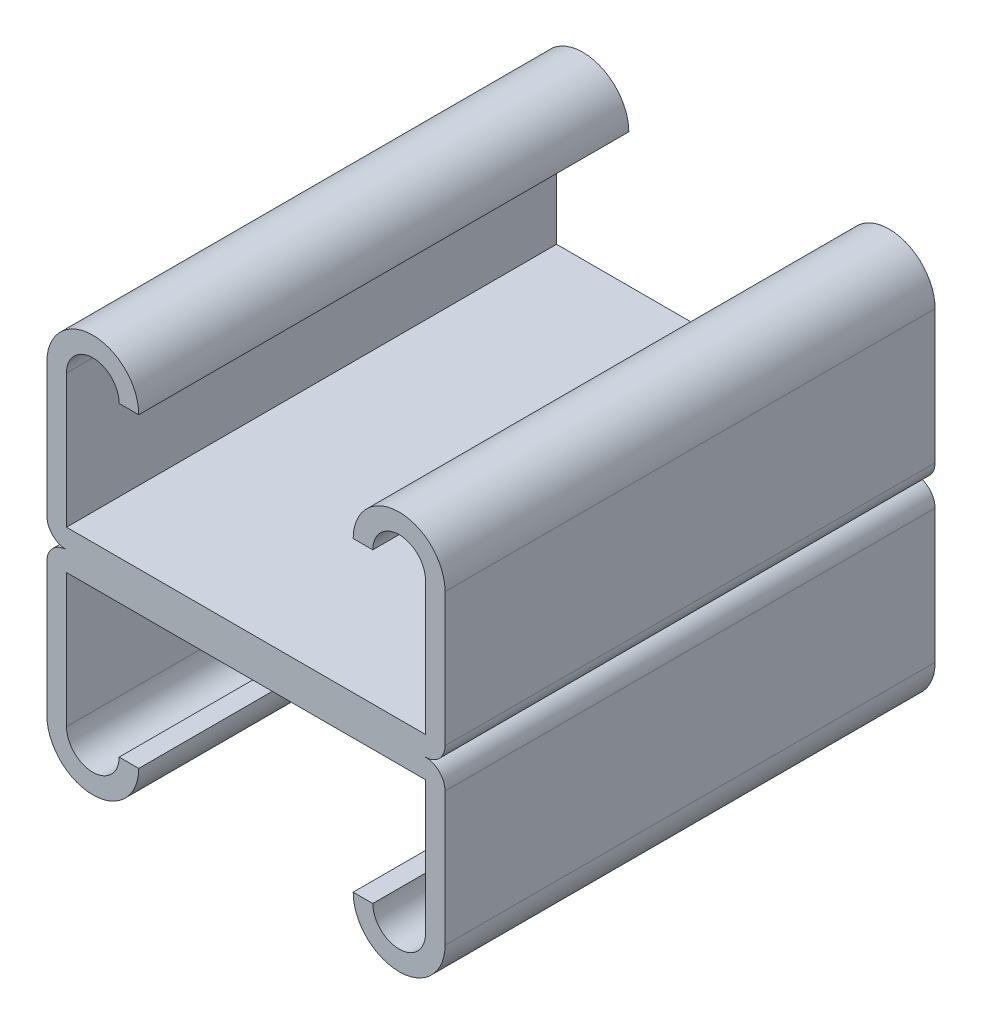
ISO-10303-21;
HEADER;
FILE_DESCRIPTION(('STEP AP214'),'2;1');
FILE_NAME('part.step','',(''),(''),'','','');
FILE_SCHEMA(('AUTOMOTIVE_DESIGN { 1 0 10303 214 1 1 1 1 }'));
ENDSEC;
DATA;
#1=APPLICATION_CONTEXT('core data for automotive mechanical design processes');
#2=APPLICATION_PROTOCOL_DEFINITION('international standard','automotive_design',2000,#1);
#3=PRODUCT_CONTEXT('',#1,'mechanical');
#4=PRODUCT('Part','Part','',(#3));
#5=PRODUCT_RELATED_PRODUCT_CATEGORY('part','',(#4));
#6=PRODUCT_DEFINITION_FORMATION('','',#4);
#7=PRODUCT_DEFINITION_CONTEXT('part definition',#1,'design');
#8=PRODUCT_DEFINITION('design','',#6,#7);
#9=PRODUCT_DEFINITION_SHAPE('','',#8);
#10=(LENGTH_UNIT() NAMED_UNIT(*) SI_UNIT(.MILLI.,.METRE.));
#11=(NAMED_UNIT(*) PLANE_ANGLE_UNIT() SI_UNIT($,.RADIAN.));
#12=(NAMED_UNIT(*) SI_UNIT($,.STERADIAN.) SOLID_ANGLE_UNIT());
#13=UNCERTAINTY_MEASURE_WITH_UNIT(LENGTH_MEASURE(1.E-05),#10,'distance_accuracy_value','');
#14=(GEOMETRIC_REPRESENTATION_CONTEXT(3) GLOBAL_UNCERTAINTY_ASSIGNED_CONTEXT((#13)) GLOBAL_UNIT_ASSIGNED_CONTEXT((#10,
#11,#12)) REPRESENTATION_CONTEXT('',''));
#15=CARTESIAN_POINT('',(0.,0.,0.));
#16=DIRECTION('',(0.,0.,1.));
#17=DIRECTION('',(1.,0.,0.));
#18=AXIS2_PLACEMENT_3D('',#15,#16,#17);
#19=CARTESIAN_POINT('',(-7.9375,7.9375,12.7));
#20=DIRECTION('',(0.,0.,-1.));
#21=DIRECTION('',(-1.,0.,0.));
#22=AXIS2_PLACEMENT_3D('',#19,#20,#21);
#23=CYLINDRICAL_SURFACE('',#22,2.38125);
#24=CARTESIAN_POINT('',(-7.9375,7.9375,-12.7));
#25=DIRECTION('',(0.,0.,1.));
#26=DIRECTION('',(-1.,0.,0.));
#27=AXIS2_PLACEMENT_3D('',#24,#25,#26);
#28=CIRCLE('',#27,2.38125);
#29=CARTESIAN_POINT('',(-5.55625,7.9375,-12.7));
#30=VERTEX_POINT('',#29);
#31=CARTESIAN_POINT('',(-10.31875,7.9375,-12.7));
#32=VERTEX_POINT('',#31);
#33=EDGE_CURVE('E172',#30,#32,#28,.T.);
#34=ORIENTED_EDGE('',*,*,#33,.T.);
#35=DIRECTION('',(0.,0.,-1.));
#36=VECTOR('',#35,1.);
#37=CARTESIAN_POINT('',(-10.31875,7.9375,12.7));
#38=LINE('',#37,#36);
#39=CARTESIAN_POINT('',(-10.31875,7.9375,12.7));
#40=VERTEX_POINT('',#39);
#41=EDGE_CURVE('E11',#40,#32,#38,.T.);
#42=ORIENTED_EDGE('',*,*,#41,.F.);
#43=CARTESIAN_POINT('',(-7.9375,7.9375,12.7));
#44=DIRECTION('',(0.,0.,1.));
#45=DIRECTION('',(-1.,0.,0.));
#46=AXIS2_PLACEMENT_3D('',#43,#44,#45);
#47=CIRCLE('',#46,2.38125);
#48=CARTESIAN_POINT('',(-5.55625,7.9375,12.7));
#49=VERTEX_POINT('',#48);
#50=EDGE_CURVE('E197',#49,#40,#47,.T.);
#51=ORIENTED_EDGE('',*,*,#50,.F.);
#52=DIRECTION('',(0.,0.,-1.));
#53=VECTOR('',#52,1.);
#54=CARTESIAN_POINT('',(-5.55625,7.9375,12.7));
#55=LINE('',#54,#53);
#56=EDGE_CURVE('E168',#49,#30,#55,.T.);
#57=ORIENTED_EDGE('',*,*,#56,.T.);
#58=EDGE_LOOP('',(#34,#42,#51,#57));
#59=FACE_BOUND('',#58,.T.);
#60=ADVANCED_FACE('F39',(#59),#23,.T.);
#61=CARTESIAN_POINT('',(-10.31875,7.9375,12.7));
#62=DIRECTION('',(1.,0.,0.));
#63=DIRECTION('',(0.,1.,0.));
#64=AXIS2_PLACEMENT_3D('',#61,#62,#63);
#65=PLANE('',#64);
#66=DIRECTION('',(0.,-1.,0.));
#67=VECTOR('',#66,1.);
#68=CARTESIAN_POINT('',(-10.31875,7.9375,-12.7));
#69=LINE('',#68,#67);
#70=CARTESIAN_POINT('',(-10.31875,1.016,-12.7));
#71=VERTEX_POINT('',#70);
#72=EDGE_CURVE('E175',#32,#71,#69,.T.);
#73=ORIENTED_EDGE('',*,*,#72,.T.);
#74=DIRECTION('',(0.,0.,-1.));
#75=VECTOR('',#74,1.);
#76=CARTESIAN_POINT('',(-10.31875,1.016,12.7));
#77=LINE('',#76,#75);
#78=CARTESIAN_POINT('',(-10.31875,1.016,12.7));
#79=VERTEX_POINT('',#78);
#80=EDGE_CURVE('E47',#79,#71,#77,.T.);
#81=ORIENTED_EDGE('',*,*,#80,.F.);
#82=DIRECTION('',(0.,-1.,0.));
#83=VECTOR('',#82,1.);
#84=CARTESIAN_POINT('',(-10.31875,7.9375,12.7));
#85=LINE('',#84,#83);
#86=EDGE_CURVE('E114',#40,#79,#85,.T.);
#87=ORIENTED_EDGE('',*,*,#86,.F.);
#88=ORIENTED_EDGE('',*,*,#41,.T.);
#89=EDGE_LOOP('',(#73,#81,#87,#88));
#90=FACE_BOUND('',#89,.T.);
#91=ADVANCED_FACE('F328',(#90),#65,.F.);
#92=CARTESIAN_POINT('',(-9.30275,1.016,12.7));
#93=DIRECTION('',(0.,0.,-1.));
#94=DIRECTION('',(-1.,0.,0.));
#95=AXIS2_PLACEMENT_3D('',#92,#93,#94);
#96=CYLINDRICAL_SURFACE('',#95,1.016);
#97=CARTESIAN_POINT('',(-9.30275,1.016,-12.7));
#98=DIRECTION('',(0.,0.,1.));
#99=DIRECTION('',(-1.,0.,0.));
#100=AXIS2_PLACEMENT_3D('',#97,#98,#99);
#101=CIRCLE('',#100,1.016);
#102=CARTESIAN_POINT('',(-9.30275,0.,-12.7));
#103=VERTEX_POINT('',#102);
#104=EDGE_CURVE('E178',#71,#103,#101,.T.);
#105=ORIENTED_EDGE('',*,*,#104,.T.);
#106=DIRECTION('',(0.,0.,-1.));
#107=VECTOR('',#106,1.);
#108=CARTESIAN_POINT('',(-9.30275,0.,12.7));
#109=LINE('',#108,#107);
#110=CARTESIAN_POINT('',(-9.30275,0.,12.7));
#111=VERTEX_POINT('',#110);
#112=EDGE_CURVE('E222',#111,#103,#109,.T.);
#113=ORIENTED_EDGE('',*,*,#112,.F.);
#114=CARTESIAN_POINT('',(-9.30275,1.016,12.7));
#115=DIRECTION('',(0.,0.,1.));
#116=DIRECTION('',(-1.,0.,0.));
#117=AXIS2_PLACEMENT_3D('',#114,#115,#116);
#118=CIRCLE('',#117,1.016);
#119=EDGE_CURVE('E230',#79,#111,#118,.T.);
#120=ORIENTED_EDGE('',*,*,#119,.F.);
#121=ORIENTED_EDGE('',*,*,#80,.T.);
#122=EDGE_LOOP('',(#105,#113,#120,#121));
#123=FACE_BOUND('',#122,.T.);
#124=ADVANCED_FACE('F228',(#123),#96,.T.);
#125=CARTESIAN_POINT('',(9.30275,1.016,12.7));
#126=DIRECTION('',(0.,0.,-1.));
#127=DIRECTION('',(-1.,0.,0.));
#128=AXIS2_PLACEMENT_3D('',#125,#126,#127);
#129=CYLINDRICAL_SURFACE('',#128,1.016);
#130=CARTESIAN_POINT('',(9.30275,1.016,-12.7));
#131=DIRECTION('',(0.,0.,1.));
#132=DIRECTION('',(1.,0.,0.));
#133=AXIS2_PLACEMENT_3D('',#130,#131,#132);
#134=CIRCLE('',#133,1.016);
#135=CARTESIAN_POINT('',(9.30275,0.,-12.7));
#136=VERTEX_POINT('',#135);
#137=CARTESIAN_POINT('',(10.31875,1.016,-12.7));
#138=VERTEX_POINT('',#137);
#139=EDGE_CURVE('E180',#136,#138,#134,.T.);
#140=ORIENTED_EDGE('',*,*,#139,.T.);
#141=DIRECTION('',(0.,0.,-1.));
#142=VECTOR('',#141,1.);
#143=CARTESIAN_POINT('',(10.31875,1.016,12.7));
#144=LINE('',#143,#142);
#145=CARTESIAN_POINT('',(10.31875,1.016,12.7));
#146=VERTEX_POINT('',#145);
#147=EDGE_CURVE('E216',#146,#138,#144,.T.);
#148=ORIENTED_EDGE('',*,*,#147,.F.);
#149=CARTESIAN_POINT('',(9.30275,1.016,12.7));
#150=DIRECTION('',(0.,0.,1.));
#151=DIRECTION('',(1.,0.,0.));
#152=AXIS2_PLACEMENT_3D('',#149,#150,#151);
#153=CIRCLE('',#152,1.016);
#154=CARTESIAN_POINT('',(9.30275,0.,12.7));
#155=VERTEX_POINT('',#154);
#156=EDGE_CURVE('E292',#155,#146,#153,.T.);
#157=ORIENTED_EDGE('',*,*,#156,.F.);
#158=DIRECTION('',(0.,0.,-1.));
#159=VECTOR('',#158,1.);
#160=CARTESIAN_POINT('',(9.30275,0.,12.7));
#161=LINE('',#160,#159);
#162=EDGE_CURVE('E219',#155,#136,#161,.T.);
#163=ORIENTED_EDGE('',*,*,#162,.T.);
#164=EDGE_LOOP('',(#140,#148,#157,#163));
#165=FACE_BOUND('',#164,.T.);
#166=ADVANCED_FACE('F335',(#165),#129,.T.);
#167=CARTESIAN_POINT('',(10.31875,1.016,12.7));
#168=DIRECTION('',(-1.,0.,0.));
#169=DIRECTION('',(0.,-1.,0.));
#170=AXIS2_PLACEMENT_3D('',#167,#168,#169);
#171=PLANE('',#170);
#172=DIRECTION('',(0.,1.,0.));
#173=VECTOR('',#172,1.);
#174=CARTESIAN_POINT('',(10.31875,1.016,-12.7));
#175=LINE('',#174,#173);
#176=CARTESIAN_POINT('',(10.31875,7.9375,-12.7));
#177=VERTEX_POINT('',#176);
#178=EDGE_CURVE('E182',#138,#177,#175,.T.);
#179=ORIENTED_EDGE('',*,*,#178,.T.);
#180=DIRECTION('',(0.,0.,-1.));
#181=VECTOR('',#180,1.);
#182=CARTESIAN_POINT('',(10.31875,7.9375,12.7));
#183=LINE('',#182,#181);
#184=CARTESIAN_POINT('',(10.31875,7.9375,12.7));
#185=VERTEX_POINT('',#184);
#186=EDGE_CURVE('E213',#185,#177,#183,.T.);
#187=ORIENTED_EDGE('',*,*,#186,.F.);
#188=DIRECTION('',(0.,1.,0.));
#189=VECTOR('',#188,1.);
#190=CARTESIAN_POINT('',(10.31875,1.016,12.7));
#191=LINE('',#190,#189);
#192=EDGE_CURVE('E294',#146,#185,#191,.T.);
#193=ORIENTED_EDGE('',*,*,#192,.F.);
#194=ORIENTED_EDGE('',*,*,#147,.T.);
#195=EDGE_LOOP('',(#179,#187,#193,#194));
#196=FACE_BOUND('',#195,.T.);
#197=ADVANCED_FACE('F340',(#196),#171,.F.);
#198=CARTESIAN_POINT('',(7.9375,7.9375,12.7));
#199=DIRECTION('',(0.,0.,-1.));
#200=DIRECTION('',(-1.,0.,0.));
#201=AXIS2_PLACEMENT_3D('',#198,#199,#200);
#202=CYLINDRICAL_SURFACE('',#201,2.38125);
#203=CARTESIAN_POINT('',(7.9375,7.9375,-12.7));
#204=DIRECTION('',(0.,0.,1.));
#205=DIRECTION('',(1.,0.,0.));
#206=AXIS2_PLACEMENT_3D('',#203,#204,#205);
#207=CIRCLE('',#206,2.38125);
#208=CARTESIAN_POINT('',(5.55625,7.9375,-12.7));
#209=VERTEX_POINT('',#208);
#210=EDGE_CURVE('E184',#177,#209,#207,.T.);
#211=ORIENTED_EDGE('',*,*,#210,.T.);
#212=DIRECTION('',(0.,0.,-1.));
#213=VECTOR('',#212,1.);
#214=CARTESIAN_POINT('',(5.55625,7.9375,12.7));
#215=LINE('',#214,#213);
#216=CARTESIAN_POINT('',(5.55625,7.9375,12.7));
#217=VERTEX_POINT('',#216);
#218=EDGE_CURVE('E210',#217,#209,#215,.T.);
#219=ORIENTED_EDGE('',*,*,#218,.F.);
#220=CARTESIAN_POINT('',(7.9375,7.9375,12.7));
#221=DIRECTION('',(0.,0.,1.));
#222=DIRECTION('',(1.,0.,0.));
#223=AXIS2_PLACEMENT_3D('',#220,#221,#222);
#224=CIRCLE('',#223,2.38125);
#225=EDGE_CURVE('E296',#185,#217,#224,.T.);
#226=ORIENTED_EDGE('',*,*,#225,.F.);
#227=ORIENTED_EDGE('',*,*,#186,.T.);
#228=EDGE_LOOP('',(#211,#219,#226,#227));
#229=FACE_BOUND('',#228,.T.);
#230=ADVANCED_FACE('F343',(#229),#202,.T.);
#231=CARTESIAN_POINT('',(5.55625,7.9375,12.7));
#232=DIRECTION('',(0.,1.,0.));
#233=DIRECTION('',(0.,0.,1.));
#234=AXIS2_PLACEMENT_3D('',#231,#232,#233);
#235=PLANE('',#234);
#236=DIRECTION('',(1.,0.,0.));
#237=VECTOR('',#236,1.);
#238=CARTESIAN_POINT('',(5.55625,7.9375,-12.7));
#239=LINE('',#238,#237);
#240=CARTESIAN_POINT('',(6.57225,7.9375,-12.7));
#241=VERTEX_POINT('',#240);
#242=EDGE_CURVE('E186',#209,#241,#239,.T.);
#243=ORIENTED_EDGE('',*,*,#242,.T.);
#244=DIRECTION('',(0.,0.,-1.));
#245=VECTOR('',#244,1.);
#246=CARTESIAN_POINT('',(6.57225,7.9375,12.7));
#247=LINE('',#246,#245);
#248=CARTESIAN_POINT('',(6.57225,7.9375,12.7));
#249=VERTEX_POINT('',#248);
#250=EDGE_CURVE('E207',#249,#241,#247,.T.);
#251=ORIENTED_EDGE('',*,*,#250,.F.);
#252=DIRECTION('',(1.,0.,0.));
#253=VECTOR('',#252,1.);
#254=CARTESIAN_POINT('',(5.55625,7.9375,12.7));
#255=LINE('',#254,#253);
#256=EDGE_CURVE('E298',#217,#249,#255,.T.);
#257=ORIENTED_EDGE('',*,*,#256,.F.);
#258=ORIENTED_EDGE('',*,*,#218,.T.);
#259=EDGE_LOOP('',(#243,#251,#257,#258));
#260=FACE_BOUND('',#259,.T.);
#261=ADVANCED_FACE('F347',(#260),#235,.F.);
#262=CARTESIAN_POINT('',(7.9375,7.9375,12.7));
#263=DIRECTION('',(0.,0.,-1.));
#264=DIRECTION('',(-1.,0.,0.));
#265=AXIS2_PLACEMENT_3D('',#262,#263,#264);
#266=CYLINDRICAL_SURFACE('',#265,1.36525);
#267=CARTESIAN_POINT('',(7.9375,7.9375,-12.7));
#268=DIRECTION('',(0.,0.,-1.));
#269=DIRECTION('',(1.,0.,0.));
#270=AXIS2_PLACEMENT_3D('',#267,#268,#269);
#271=CIRCLE('',#270,1.36525);
#272=CARTESIAN_POINT('',(9.30275,7.9375,-12.7));
#273=VERTEX_POINT('',#272);
#274=EDGE_CURVE('E188',#241,#273,#271,.T.);
#275=ORIENTED_EDGE('',*,*,#274,.T.);
#276=DIRECTION('',(0.,0.,-1.));
#277=VECTOR('',#276,1.);
#278=CARTESIAN_POINT('',(9.30275,7.9375,12.7));
#279=LINE('',#278,#277);
#280=CARTESIAN_POINT('',(9.30275,7.9375,12.7));
#281=VERTEX_POINT('',#280);
#282=EDGE_CURVE('E204',#281,#273,#279,.T.);
#283=ORIENTED_EDGE('',*,*,#282,.F.);
#284=CARTESIAN_POINT('',(7.9375,7.9375,12.7));
#285=DIRECTION('',(0.,0.,-1.));
#286=DIRECTION('',(1.,0.,0.));
#287=AXIS2_PLACEMENT_3D('',#284,#285,#286);
#288=CIRCLE('',#287,1.36525);
#289=EDGE_CURVE('E300',#249,#281,#288,.T.);
#290=ORIENTED_EDGE('',*,*,#289,.F.);
#291=ORIENTED_EDGE('',*,*,#250,.T.);
#292=EDGE_LOOP('',(#275,#283,#290,#291));
#293=FACE_BOUND('',#292,.T.);
#294=ADVANCED_FACE('F351',(#293),#266,.F.);
#295=CARTESIAN_POINT('',(9.30275,1.016,12.7));
#296=DIRECTION('',(1.,0.,0.));
#297=DIRECTION('',(0.,1.,0.));
#298=AXIS2_PLACEMENT_3D('',#295,#296,#297);
#299=PLANE('',#298);
#300=DIRECTION('',(0.,-1.,0.));
#301=VECTOR('',#300,1.);
#302=CARTESIAN_POINT('',(9.30275,1.016,-12.7));
#303=LINE('',#302,#301);
#304=CARTESIAN_POINT('',(9.30275,1.016,-12.7));
#305=VERTEX_POINT('',#304);
#306=EDGE_CURVE('E190',#273,#305,#303,.T.);
#307=ORIENTED_EDGE('',*,*,#306,.T.);
#308=DIRECTION('',(0.,0.,-1.));
#309=VECTOR('',#308,1.);
#310=CARTESIAN_POINT('',(9.30275,1.016,12.7));
#311=LINE('',#310,#309);
#312=CARTESIAN_POINT('',(9.30275,1.016,12.7));
#313=VERTEX_POINT('',#312);
#314=EDGE_CURVE('E201',#313,#305,#311,.T.);
#315=ORIENTED_EDGE('',*,*,#314,.F.);
#316=DIRECTION('',(0.,-1.,0.));
#317=VECTOR('',#316,1.);
#318=CARTESIAN_POINT('',(9.30275,1.016,12.7));
#319=LINE('',#318,#317);
#320=EDGE_CURVE('E302',#281,#313,#319,.T.);
#321=ORIENTED_EDGE('',*,*,#320,.F.);
#322=ORIENTED_EDGE('',*,*,#282,.T.);
#323=EDGE_LOOP('',(#307,#315,#321,#322));
#324=FACE_BOUND('',#323,.T.);
#325=ADVANCED_FACE('F308',(#324),#299,.F.);
#326=CARTESIAN_POINT('',(-9.30275,1.016,12.7));
#327=DIRECTION('',(0.,-1.,0.));
#328=DIRECTION('',(1.,0.,0.));
#329=AXIS2_PLACEMENT_3D('',#326,#327,#328);
#330=PLANE('',#329);
#331=DIRECTION('',(-1.,0.,0.));
#332=VECTOR('',#331,1.);
#333=CARTESIAN_POINT('',(-9.30275,1.016,-12.7));
#334=LINE('',#333,#332);
#335=CARTESIAN_POINT('',(-9.30275,1.016,-12.7));
#336=VERTEX_POINT('',#335);
#337=EDGE_CURVE('E192',#305,#336,#334,.T.);
#338=ORIENTED_EDGE('',*,*,#337,.T.);
#339=DIRECTION('',(0.,0.,-1.));
#340=VECTOR('',#339,1.);
#341=CARTESIAN_POINT('',(-9.30275,1.016,12.7));
#342=LINE('',#341,#340);
#343=CARTESIAN_POINT('',(-9.30275,1.016,12.7));
#344=VERTEX_POINT('',#343);
#345=EDGE_CURVE('E163',#344,#336,#342,.T.);
#346=ORIENTED_EDGE('',*,*,#345,.F.);
#347=DIRECTION('',(-1.,0.,0.));
#348=VECTOR('',#347,1.);
#349=CARTESIAN_POINT('',(-9.30275,1.016,12.7));
#350=LINE('',#349,#348);
#351=EDGE_CURVE('E154',#313,#344,#350,.T.);
#352=ORIENTED_EDGE('',*,*,#351,.F.);
#353=ORIENTED_EDGE('',*,*,#314,.T.);
#354=EDGE_LOOP('',(#338,#346,#352,#353));
#355=FACE_BOUND('',#354,.T.);
#356=ADVANCED_FACE('F312',(#355),#330,.F.);
#357=CARTESIAN_POINT('',(-9.30275,7.9375,12.7));
#358=DIRECTION('',(-1.,0.,0.));
#359=DIRECTION('',(0.,-1.,0.));
#360=AXIS2_PLACEMENT_3D('',#357,#358,#359);
#361=PLANE('',#360);
#362=DIRECTION('',(0.,1.,0.));
#363=VECTOR('',#362,1.);
#364=CARTESIAN_POINT('',(-9.30275,7.9375,-12.7));
#365=LINE('',#364,#363);
#366=CARTESIAN_POINT('',(-9.30275,7.9375,-12.7));
#367=VERTEX_POINT('',#366);
#368=EDGE_CURVE('E162',#336,#367,#365,.T.);
#369=ORIENTED_EDGE('',*,*,#368,.T.);
#370=DIRECTION('',(0.,0.,-1.));
#371=VECTOR('',#370,1.);
#372=CARTESIAN_POINT('',(-9.30275,7.9375,12.7));
#373=LINE('',#372,#371);
#374=CARTESIAN_POINT('',(-9.30275,7.9375,12.7));
#375=VERTEX_POINT('',#374);
#376=EDGE_CURVE('E159',#375,#367,#373,.T.);
#377=ORIENTED_EDGE('',*,*,#376,.F.);
#378=DIRECTION('',(0.,1.,0.));
#379=VECTOR('',#378,1.);
#380=CARTESIAN_POINT('',(-9.30275,7.9375,12.7));
#381=LINE('',#380,#379);
#382=EDGE_CURVE('E148',#344,#375,#381,.T.);
#383=ORIENTED_EDGE('',*,*,#382,.F.);
#384=ORIENTED_EDGE('',*,*,#345,.T.);
#385=EDGE_LOOP('',(#369,#377,#383,#384));
#386=FACE_BOUND('',#385,.T.);
#387=ADVANCED_FACE('F160',(#386),#361,.F.);
#388=CARTESIAN_POINT('',(-7.9375,7.9375,12.7));
#389=DIRECTION('',(0.,0.,-1.));
#390=DIRECTION('',(-1.,0.,0.));
#391=AXIS2_PLACEMENT_3D('',#388,#389,#390);
#392=CYLINDRICAL_SURFACE('',#391,1.36525);
#393=CARTESIAN_POINT('',(-7.9375,7.9375,-12.7));
#394=DIRECTION('',(0.,0.,-1.));
#395=DIRECTION('',(-1.,0.,0.));
#396=AXIS2_PLACEMENT_3D('',#393,#394,#395);
#397=CIRCLE('',#396,1.36525);
#398=CARTESIAN_POINT('',(-6.57225,7.9375,-12.7));
#399=VERTEX_POINT('',#398);
#400=EDGE_CURVE('E100',#367,#399,#397,.T.);
#401=ORIENTED_EDGE('',*,*,#400,.T.);
#402=DIRECTION('',(0.,0.,-1.));
#403=VECTOR('',#402,1.);
#404=CARTESIAN_POINT('',(-6.57225,7.9375,12.7));
#405=LINE('',#404,#403);
#406=CARTESIAN_POINT('',(-6.57225,7.9375,12.7));
#407=VERTEX_POINT('',#406);
#408=EDGE_CURVE('E164',#407,#399,#405,.T.);
#409=ORIENTED_EDGE('',*,*,#408,.F.);
#410=CARTESIAN_POINT('',(-7.9375,7.9375,12.7));
#411=DIRECTION('',(0.,0.,-1.));
#412=DIRECTION('',(-1.,0.,0.));
#413=AXIS2_PLACEMENT_3D('',#410,#411,#412);
#414=CIRCLE('',#413,1.36525);
#415=EDGE_CURVE('E152',#375,#407,#414,.T.);
#416=ORIENTED_EDGE('',*,*,#415,.F.);
#417=ORIENTED_EDGE('',*,*,#376,.T.);
#418=EDGE_LOOP('',(#401,#409,#416,#417));
#419=FACE_BOUND('',#418,.T.);
#420=ADVANCED_FACE('F166',(#419),#392,.F.);
#421=CARTESIAN_POINT('',(-6.57225,7.9375,12.7));
#422=DIRECTION('',(0.,1.,0.));
#423=DIRECTION('',(0.,0.,1.));
#424=AXIS2_PLACEMENT_3D('',#421,#422,#423);
#425=PLANE('',#424);
#426=DIRECTION('',(1.,0.,0.));
#427=VECTOR('',#426,1.);
#428=CARTESIAN_POINT('',(-6.57225,7.9375,-12.7));
#429=LINE('',#428,#427);
#430=EDGE_CURVE('E106',#399,#30,#429,.T.);
#431=ORIENTED_EDGE('',*,*,#430,.T.);
#432=ORIENTED_EDGE('',*,*,#56,.F.);
#433=DIRECTION('',(1.,0.,0.));
#434=VECTOR('',#433,1.);
#435=CARTESIAN_POINT('',(-6.57225,7.9375,12.7));
#436=LINE('',#435,#434);
#437=EDGE_CURVE('E55',#407,#49,#436,.T.);
#438=ORIENTED_EDGE('',*,*,#437,.F.);
#439=ORIENTED_EDGE('',*,*,#408,.T.);
#440=EDGE_LOOP('',(#431,#432,#438,#439));
#441=FACE_BOUND('',#440,.T.);
#442=ADVANCED_FACE('F316',(#441),#425,.F.);
#443=CARTESIAN_POINT('',(-7.9375,7.9375,12.7));
#444=DIRECTION('',(0.,0.,-1.));
#445=DIRECTION('',(-1.,0.,0.));
#446=AXIS2_PLACEMENT_3D('',#443,#444,#445);
#447=PLANE('',#446);
#448=ORIENTED_EDGE('',*,*,#50,.T.);
#449=ORIENTED_EDGE('',*,*,#86,.T.);
#450=ORIENTED_EDGE('',*,*,#119,.T.);
#451=CARTESIAN_POINT('',(-9.30275,-1.016,12.7));
#452=DIRECTION('',(0.,0.,-1.));
#453=DIRECTION('',(-1.,0.,0.));
#454=AXIS2_PLACEMENT_3D('',#451,#452,#453);
#455=CIRCLE('',#454,1.016);
#456=CARTESIAN_POINT('',(-10.31875,-1.016,12.7));
#457=VERTEX_POINT('',#456);
#458=EDGE_CURVE('E627',#457,#111,#455,.T.);
#459=ORIENTED_EDGE('',*,*,#458,.F.);
#460=DIRECTION('',(0.,1.,0.));
#461=VECTOR('',#460,1.);
#462=CARTESIAN_POINT('',(-10.31875,-7.9375,12.7));
#463=LINE('',#462,#461);
#464=CARTESIAN_POINT('',(-10.31875,-7.9375,12.7));
#465=VERTEX_POINT('',#464);
#466=EDGE_CURVE('E257',#465,#457,#463,.T.);
#467=ORIENTED_EDGE('',*,*,#466,.F.);
#468=CARTESIAN_POINT('',(-7.9375,-7.9375,12.7));
#469=DIRECTION('',(0.,0.,-1.));
#470=DIRECTION('',(-1.,0.,0.));
#471=AXIS2_PLACEMENT_3D('',#468,#469,#470);
#472=CIRCLE('',#471,2.38125);
#473=CARTESIAN_POINT('',(-5.55625,-7.9375,12.7));
#474=VERTEX_POINT('',#473);
#475=EDGE_CURVE('E246',#474,#465,#472,.T.);
#476=ORIENTED_EDGE('',*,*,#475,.F.);
#477=DIRECTION('',(1.,0.,0.));
#478=VECTOR('',#477,1.);
#479=CARTESIAN_POINT('',(-6.57225,-7.9375,12.7));
#480=LINE('',#479,#478);
#481=CARTESIAN_POINT('',(-6.57225,-7.9375,12.7));
#482=VERTEX_POINT('',#481);
#483=EDGE_CURVE('E588',#482,#474,#480,.T.);
#484=ORIENTED_EDGE('',*,*,#483,.F.);
#485=CARTESIAN_POINT('',(-7.9375,-7.9375,12.7));
#486=DIRECTION('',(0.,0.,1.));
#487=DIRECTION('',(-1.,0.,0.));
#488=AXIS2_PLACEMENT_3D('',#485,#486,#487);
#489=CIRCLE('',#488,1.36525);
#490=CARTESIAN_POINT('',(-9.30275,-7.9375,12.7));
#491=VERTEX_POINT('',#490);
#492=EDGE_CURVE('E597',#491,#482,#489,.T.);
#493=ORIENTED_EDGE('',*,*,#492,.F.);
#494=DIRECTION('',(0.,-1.,0.));
#495=VECTOR('',#494,1.);
#496=CARTESIAN_POINT('',(-9.30275,-7.9375,12.7));
#497=LINE('',#496,#495);
#498=CARTESIAN_POINT('',(-9.30275,-1.016,12.7));
#499=VERTEX_POINT('',#498);
#500=EDGE_CURVE('E601',#499,#491,#497,.T.);
#501=ORIENTED_EDGE('',*,*,#500,.F.);
#502=DIRECTION('',(-1.,0.,0.));
#503=VECTOR('',#502,1.);
#504=CARTESIAN_POINT('',(-9.30275,-1.016,12.7));
#505=LINE('',#504,#503);
#506=CARTESIAN_POINT('',(9.30275,-1.016,12.7));
#507=VERTEX_POINT('',#506);
#508=EDGE_CURVE('E603',#507,#499,#505,.T.);
#509=ORIENTED_EDGE('',*,*,#508,.F.);
#510=DIRECTION('',(0.,1.,0.));
#511=VECTOR('',#510,1.);
#512=CARTESIAN_POINT('',(9.30275,-1.016,12.7));
#513=LINE('',#512,#511);
#514=CARTESIAN_POINT('',(9.30275,-7.9375,12.7));
#515=VERTEX_POINT('',#514);
#516=EDGE_CURVE('E609',#515,#507,#513,.T.);
#517=ORIENTED_EDGE('',*,*,#516,.F.);
#518=CARTESIAN_POINT('',(7.9375,-7.9375,12.7));
#519=DIRECTION('',(0.,0.,1.));
#520=DIRECTION('',(1.,0.,0.));
#521=AXIS2_PLACEMENT_3D('',#518,#519,#520);
#522=CIRCLE('',#521,1.36525);
#523=CARTESIAN_POINT('',(6.57225,-7.9375,12.7));
#524=VERTEX_POINT('',#523);
#525=EDGE_CURVE('E612',#524,#515,#522,.T.);
#526=ORIENTED_EDGE('',*,*,#525,.F.);
#527=DIRECTION('',(1.,0.,0.));
#528=VECTOR('',#527,1.);
#529=CARTESIAN_POINT('',(5.55625,-7.9375,12.7));
#530=LINE('',#529,#528);
#531=CARTESIAN_POINT('',(5.55625,-7.9375,12.7));
#532=VERTEX_POINT('',#531);
#533=EDGE_CURVE('E615',#532,#524,#530,.T.);
#534=ORIENTED_EDGE('',*,*,#533,.F.);
#535=CARTESIAN_POINT('',(7.9375,-7.9375,12.7));
#536=DIRECTION('',(0.,0.,-1.));
#537=DIRECTION('',(1.,0.,0.));
#538=AXIS2_PLACEMENT_3D('',#535,#536,#537);
#539=CIRCLE('',#538,2.38125);
#540=CARTESIAN_POINT('',(10.31875,-7.9375,12.7));
#541=VERTEX_POINT('',#540);
#542=EDGE_CURVE('E618',#541,#532,#539,.T.);
#543=ORIENTED_EDGE('',*,*,#542,.F.);
#544=DIRECTION('',(0.,-1.,0.));
#545=VECTOR('',#544,1.);
#546=CARTESIAN_POINT('',(10.31875,-1.016,12.7));
#547=LINE('',#546,#545);
#548=CARTESIAN_POINT('',(10.31875,-1.016,12.7));
#549=VERTEX_POINT('',#548);
#550=EDGE_CURVE('E621',#549,#541,#547,.T.);
#551=ORIENTED_EDGE('',*,*,#550,.F.);
#552=CARTESIAN_POINT('',(9.30275,-1.016,12.7));
#553=DIRECTION('',(0.,0.,-1.));
#554=DIRECTION('',(1.,0.,0.));
#555=AXIS2_PLACEMENT_3D('',#552,#553,#554);
#556=CIRCLE('',#555,1.016);
#557=EDGE_CURVE('E624',#155,#549,#556,.T.);
#558=ORIENTED_EDGE('',*,*,#557,.F.);
#559=ORIENTED_EDGE('',*,*,#156,.T.);
#560=ORIENTED_EDGE('',*,*,#192,.T.);
#561=ORIENTED_EDGE('',*,*,#225,.T.);
#562=ORIENTED_EDGE('',*,*,#256,.T.);
#563=ORIENTED_EDGE('',*,*,#289,.T.);
#564=ORIENTED_EDGE('',*,*,#320,.T.);
#565=ORIENTED_EDGE('',*,*,#351,.T.);
#566=ORIENTED_EDGE('',*,*,#382,.T.);
#567=ORIENTED_EDGE('',*,*,#415,.T.);
#568=ORIENTED_EDGE('',*,*,#437,.T.);
#569=EDGE_LOOP('',(#448,#449,#450,#459,#467,#476,#484,#493,#501,#509,#517,#526,#534,#543,#551,
#558,#559,#560,#561,#562,#563,#564,#565,#566,#567,#568));
#570=FACE_BOUND('',#569,.T.);
#571=ADVANCED_FACE('F150',(#570),#447,.F.);
#572=CARTESIAN_POINT('',(-7.9375,7.9375,-12.7));
#573=DIRECTION('',(0.,0.,-1.));
#574=DIRECTION('',(-1.,0.,0.));
#575=AXIS2_PLACEMENT_3D('',#572,#573,#574);
#576=PLANE('',#575);
#577=ORIENTED_EDGE('',*,*,#33,.F.);
#578=ORIENTED_EDGE('',*,*,#430,.F.);
#579=ORIENTED_EDGE('',*,*,#400,.F.);
#580=ORIENTED_EDGE('',*,*,#368,.F.);
#581=ORIENTED_EDGE('',*,*,#337,.F.);
#582=ORIENTED_EDGE('',*,*,#306,.F.);
#583=ORIENTED_EDGE('',*,*,#274,.F.);
#584=ORIENTED_EDGE('',*,*,#242,.F.);
#585=ORIENTED_EDGE('',*,*,#210,.F.);
#586=ORIENTED_EDGE('',*,*,#178,.F.);
#587=ORIENTED_EDGE('',*,*,#139,.F.);
#588=CARTESIAN_POINT('',(9.30275,-1.016,-12.7));
#589=DIRECTION('',(0.,0.,-1.));
#590=DIRECTION('',(1.,0.,0.));
#591=AXIS2_PLACEMENT_3D('',#588,#589,#590);
#592=CIRCLE('',#591,1.016);
#593=CARTESIAN_POINT('',(10.31875,-1.016,-12.7));
#594=VERTEX_POINT('',#593);
#595=EDGE_CURVE('E244',#136,#594,#592,.T.);
#596=ORIENTED_EDGE('',*,*,#595,.T.);
#597=DIRECTION('',(0.,-1.,0.));
#598=VECTOR('',#597,1.);
#599=CARTESIAN_POINT('',(10.31875,-1.016,-12.7));
#600=LINE('',#599,#598);
#601=CARTESIAN_POINT('',(10.31875,-7.9375,-12.7));
#602=VERTEX_POINT('',#601);
#603=EDGE_CURVE('E249',#594,#602,#600,.T.);
#604=ORIENTED_EDGE('',*,*,#603,.T.);
#605=CARTESIAN_POINT('',(7.9375,-7.9375,-12.7));
#606=DIRECTION('',(0.,0.,-1.));
#607=DIRECTION('',(1.,0.,0.));
#608=AXIS2_PLACEMENT_3D('',#605,#606,#607);
#609=CIRCLE('',#608,2.38125);
#610=CARTESIAN_POINT('',(5.55625,-7.9375,-12.7));
#611=VERTEX_POINT('',#610);
#612=EDGE_CURVE('E651',#602,#611,#609,.T.);
#613=ORIENTED_EDGE('',*,*,#612,.T.);
#614=DIRECTION('',(1.,0.,0.));
#615=VECTOR('',#614,1.);
#616=CARTESIAN_POINT('',(5.55625,-7.9375,-12.7));
#617=LINE('',#616,#615);
#618=CARTESIAN_POINT('',(6.57225,-7.9375,-12.7));
#619=VERTEX_POINT('',#618);
#620=EDGE_CURVE('E648',#611,#619,#617,.T.);
#621=ORIENTED_EDGE('',*,*,#620,.T.);
#622=CARTESIAN_POINT('',(7.9375,-7.9375,-12.7));
#623=DIRECTION('',(0.,0.,1.));
#624=DIRECTION('',(1.,0.,0.));
#625=AXIS2_PLACEMENT_3D('',#622,#623,#624);
#626=CIRCLE('',#625,1.36525);
#627=CARTESIAN_POINT('',(9.30275,-7.9375,-12.7));
#628=VERTEX_POINT('',#627);
#629=EDGE_CURVE('E645',#619,#628,#626,.T.);
#630=ORIENTED_EDGE('',*,*,#629,.T.);
#631=DIRECTION('',(0.,1.,0.));
#632=VECTOR('',#631,1.);
#633=CARTESIAN_POINT('',(9.30275,-1.016,-12.7));
#634=LINE('',#633,#632);
#635=CARTESIAN_POINT('',(9.30275,-1.016,-12.7));
#636=VERTEX_POINT('',#635);
#637=EDGE_CURVE('E642',#628,#636,#634,.T.);
#638=ORIENTED_EDGE('',*,*,#637,.T.);
#639=DIRECTION('',(-1.,0.,0.));
#640=VECTOR('',#639,1.);
#641=CARTESIAN_POINT('',(-9.30275,-1.016,-12.7));
#642=LINE('',#641,#640);
#643=CARTESIAN_POINT('',(-9.30275,-1.016,-12.7));
#644=VERTEX_POINT('',#643);
#645=EDGE_CURVE('E639',#636,#644,#642,.T.);
#646=ORIENTED_EDGE('',*,*,#645,.T.);
#647=DIRECTION('',(0.,-1.,0.));
#648=VECTOR('',#647,1.);
#649=CARTESIAN_POINT('',(-9.30275,-7.9375,-12.7));
#650=LINE('',#649,#648);
#651=CARTESIAN_POINT('',(-9.30275,-7.9375,-12.7));
#652=VERTEX_POINT('',#651);
#653=EDGE_CURVE('E636',#644,#652,#650,.T.);
#654=ORIENTED_EDGE('',*,*,#653,.T.);
#655=CARTESIAN_POINT('',(-7.9375,-7.9375,-12.7));
#656=DIRECTION('',(0.,0.,1.));
#657=DIRECTION('',(-1.,0.,0.));
#658=AXIS2_PLACEMENT_3D('',#655,#656,#657);
#659=CIRCLE('',#658,1.36525);
#660=CARTESIAN_POINT('',(-6.57225,-7.9375,-12.7));
#661=VERTEX_POINT('',#660);
#662=EDGE_CURVE('E634',#652,#661,#659,.T.);
#663=ORIENTED_EDGE('',*,*,#662,.T.);
#664=DIRECTION('',(1.,0.,0.));
#665=VECTOR('',#664,1.);
#666=CARTESIAN_POINT('',(-6.57225,-7.9375,-12.7));
#667=LINE('',#666,#665);
#668=CARTESIAN_POINT('',(-5.55625,-7.9375,-12.7));
#669=VERTEX_POINT('',#668);
#670=EDGE_CURVE('E590',#661,#669,#667,.T.);
#671=ORIENTED_EDGE('',*,*,#670,.T.);
#672=CARTESIAN_POINT('',(-7.9375,-7.9375,-12.7));
#673=DIRECTION('',(0.,0.,-1.));
#674=DIRECTION('',(-1.,0.,0.));
#675=AXIS2_PLACEMENT_3D('',#672,#673,#674);
#676=CIRCLE('',#675,2.38125);
#677=CARTESIAN_POINT('',(-10.31875,-7.9375,-12.7));
#678=VERTEX_POINT('',#677);
#679=EDGE_CURVE('E631',#669,#678,#676,.T.);
#680=ORIENTED_EDGE('',*,*,#679,.T.);
#681=DIRECTION('',(0.,1.,0.));
#682=VECTOR('',#681,1.);
#683=CARTESIAN_POINT('',(-10.31875,-7.9375,-12.7));
#684=LINE('',#683,#682);
#685=CARTESIAN_POINT('',(-10.31875,-1.016,-12.7));
#686=VERTEX_POINT('',#685);
#687=EDGE_CURVE('E241',#678,#686,#684,.T.);
#688=ORIENTED_EDGE('',*,*,#687,.T.);
#689=CARTESIAN_POINT('',(-9.30275,-1.016,-12.7));
#690=DIRECTION('',(0.,0.,-1.));
#691=DIRECTION('',(-1.,0.,0.));
#692=AXIS2_PLACEMENT_3D('',#689,#690,#691);
#693=CIRCLE('',#692,1.016);
#694=EDGE_CURVE('E237',#686,#103,#693,.T.);
#695=ORIENTED_EDGE('',*,*,#694,.T.);
#696=ORIENTED_EDGE('',*,*,#104,.F.);
#697=ORIENTED_EDGE('',*,*,#72,.F.);
#698=EDGE_LOOP('',(#577,#578,#579,#580,#581,#582,#583,#584,#585,#586,#587,#596,#604,#613,#621,
#630,#638,#646,#654,#663,#671,#680,#688,#695,#696,#697));
#699=FACE_BOUND('',#698,.T.);
#700=ADVANCED_FACE('F234',(#699),#576,.T.);
#701=CARTESIAN_POINT('',(-7.9375,-7.9375,12.7));
#702=DIRECTION('',(0.,0.,-1.));
#703=DIRECTION('',(-1.,0.,0.));
#704=AXIS2_PLACEMENT_3D('',#701,#702,#703);
#705=CYLINDRICAL_SURFACE('',#704,2.38125);
#706=ORIENTED_EDGE('',*,*,#679,.F.);
#707=DIRECTION('',(0.,0.,-1.));
#708=VECTOR('',#707,1.);
#709=CARTESIAN_POINT('',(-5.55625,-7.9375,12.7));
#710=LINE('',#709,#708);
#711=EDGE_CURVE('E176',#474,#669,#710,.T.);
#712=ORIENTED_EDGE('',*,*,#711,.F.);
#713=ORIENTED_EDGE('',*,*,#475,.T.);
#714=DIRECTION('',(0.,0.,-1.));
#715=VECTOR('',#714,1.);
#716=CARTESIAN_POINT('',(-10.31875,-7.9375,12.7));
#717=LINE('',#716,#715);
#718=EDGE_CURVE('E253',#465,#678,#717,.T.);
#719=ORIENTED_EDGE('',*,*,#718,.T.);
#720=EDGE_LOOP('',(#706,#712,#713,#719));
#721=FACE_BOUND('',#720,.T.);
#722=ADVANCED_FACE('F392',(#721),#705,.T.);
#723=CARTESIAN_POINT('',(-6.57225,-7.9375,12.7));
#724=DIRECTION('',(0.,1.,0.));
#725=DIRECTION('',(0.,0.,1.));
#726=AXIS2_PLACEMENT_3D('',#723,#724,#725);
#727=PLANE('',#726);
#728=ORIENTED_EDGE('',*,*,#670,.F.);
#729=DIRECTION('',(0.,0.,-1.));
#730=VECTOR('',#729,1.);
#731=CARTESIAN_POINT('',(-6.57225,-7.9375,12.7));
#732=LINE('',#731,#730);
#733=EDGE_CURVE('E284',#482,#661,#732,.T.);
#734=ORIENTED_EDGE('',*,*,#733,.F.);
#735=ORIENTED_EDGE('',*,*,#483,.T.);
#736=ORIENTED_EDGE('',*,*,#711,.T.);
#737=EDGE_LOOP('',(#728,#734,#735,#736));
#738=FACE_BOUND('',#737,.T.);
#739=ADVANCED_FACE('F403',(#738),#727,.T.);
#740=CARTESIAN_POINT('',(-7.9375,-7.9375,12.7));
#741=DIRECTION('',(0.,0.,-1.));
#742=DIRECTION('',(-1.,0.,0.));
#743=AXIS2_PLACEMENT_3D('',#740,#741,#742);
#744=CYLINDRICAL_SURFACE('',#743,1.36525);
#745=ORIENTED_EDGE('',*,*,#662,.F.);
#746=DIRECTION('',(0.,0.,-1.));
#747=VECTOR('',#746,1.);
#748=CARTESIAN_POINT('',(-9.30275,-7.9375,12.7));
#749=LINE('',#748,#747);
#750=EDGE_CURVE('E281',#491,#652,#749,.T.);
#751=ORIENTED_EDGE('',*,*,#750,.F.);
#752=ORIENTED_EDGE('',*,*,#492,.T.);
#753=ORIENTED_EDGE('',*,*,#733,.T.);
#754=EDGE_LOOP('',(#745,#751,#752,#753));
#755=FACE_BOUND('',#754,.T.);
#756=ADVANCED_FACE('F413',(#755),#744,.F.);
#757=CARTESIAN_POINT('',(-9.30275,-7.9375,12.7));
#758=DIRECTION('',(1.,0.,0.));
#759=DIRECTION('',(0.,1.,0.));
#760=AXIS2_PLACEMENT_3D('',#757,#758,#759);
#761=PLANE('',#760);
#762=ORIENTED_EDGE('',*,*,#653,.F.);
#763=DIRECTION('',(0.,0.,-1.));
#764=VECTOR('',#763,1.);
#765=CARTESIAN_POINT('',(-9.30275,-1.016,12.7));
#766=LINE('',#765,#764);
#767=EDGE_CURVE('E278',#499,#644,#766,.T.);
#768=ORIENTED_EDGE('',*,*,#767,.F.);
#769=ORIENTED_EDGE('',*,*,#500,.T.);
#770=ORIENTED_EDGE('',*,*,#750,.T.);
#771=EDGE_LOOP('',(#762,#768,#769,#770));
#772=FACE_BOUND('',#771,.T.);
#773=ADVANCED_FACE('F423',(#772),#761,.T.);
#774=CARTESIAN_POINT('',(-9.30275,-1.016,12.7));
#775=DIRECTION('',(0.,-1.,0.));
#776=DIRECTION('',(1.,0.,0.));
#777=AXIS2_PLACEMENT_3D('',#774,#775,#776);
#778=PLANE('',#777);
#779=ORIENTED_EDGE('',*,*,#645,.F.);
#780=DIRECTION('',(0.,0.,-1.));
#781=VECTOR('',#780,1.);
#782=CARTESIAN_POINT('',(9.30275,-1.016,12.7));
#783=LINE('',#782,#781);
#784=EDGE_CURVE('E275',#507,#636,#783,.T.);
#785=ORIENTED_EDGE('',*,*,#784,.F.);
#786=ORIENTED_EDGE('',*,*,#508,.T.);
#787=ORIENTED_EDGE('',*,*,#767,.T.);
#788=EDGE_LOOP('',(#779,#785,#786,#787));
#789=FACE_BOUND('',#788,.T.);
#790=ADVANCED_FACE('F433',(#789),#778,.T.);
#791=CARTESIAN_POINT('',(9.30275,-1.016,12.7));
#792=DIRECTION('',(-1.,0.,0.));
#793=DIRECTION('',(0.,-1.,0.));
#794=AXIS2_PLACEMENT_3D('',#791,#792,#793);
#795=PLANE('',#794);
#796=ORIENTED_EDGE('',*,*,#637,.F.);
#797=DIRECTION('',(0.,0.,-1.));
#798=VECTOR('',#797,1.);
#799=CARTESIAN_POINT('',(9.30275,-7.9375,12.7));
#800=LINE('',#799,#798);
#801=EDGE_CURVE('E272',#515,#628,#800,.T.);
#802=ORIENTED_EDGE('',*,*,#801,.F.);
#803=ORIENTED_EDGE('',*,*,#516,.T.);
#804=ORIENTED_EDGE('',*,*,#784,.T.);
#805=EDGE_LOOP('',(#796,#802,#803,#804));
#806=FACE_BOUND('',#805,.T.);
#807=ADVANCED_FACE('F443',(#806),#795,.T.);
#808=CARTESIAN_POINT('',(7.9375,-7.9375,12.7));
#809=DIRECTION('',(0.,0.,-1.));
#810=DIRECTION('',(-1.,0.,0.));
#811=AXIS2_PLACEMENT_3D('',#808,#809,#810);
#812=CYLINDRICAL_SURFACE('',#811,1.36525);
#813=ORIENTED_EDGE('',*,*,#629,.F.);
#814=DIRECTION('',(0.,0.,-1.));
#815=VECTOR('',#814,1.);
#816=CARTESIAN_POINT('',(6.57225,-7.9375,12.7));
#817=LINE('',#816,#815);
#818=EDGE_CURVE('E269',#524,#619,#817,.T.);
#819=ORIENTED_EDGE('',*,*,#818,.F.);
#820=ORIENTED_EDGE('',*,*,#525,.T.);
#821=ORIENTED_EDGE('',*,*,#801,.T.);
#822=EDGE_LOOP('',(#813,#819,#820,#821));
#823=FACE_BOUND('',#822,.T.);
#824=ADVANCED_FACE('F453',(#823),#812,.F.);
#825=CARTESIAN_POINT('',(5.55625,-7.9375,12.7));
#826=DIRECTION('',(0.,1.,0.));
#827=DIRECTION('',(0.,0.,1.));
#828=AXIS2_PLACEMENT_3D('',#825,#826,#827);
#829=PLANE('',#828);
#830=ORIENTED_EDGE('',*,*,#620,.F.);
#831=DIRECTION('',(0.,0.,-1.));
#832=VECTOR('',#831,1.);
#833=CARTESIAN_POINT('',(5.55625,-7.9375,12.7));
#834=LINE('',#833,#832);
#835=EDGE_CURVE('E266',#532,#611,#834,.T.);
#836=ORIENTED_EDGE('',*,*,#835,.F.);
#837=ORIENTED_EDGE('',*,*,#533,.T.);
#838=ORIENTED_EDGE('',*,*,#818,.T.);
#839=EDGE_LOOP('',(#830,#836,#837,#838));
#840=FACE_BOUND('',#839,.T.);
#841=ADVANCED_FACE('F463',(#840),#829,.T.);
#842=CARTESIAN_POINT('',(7.9375,-7.9375,12.7));
#843=DIRECTION('',(0.,0.,-1.));
#844=DIRECTION('',(-1.,0.,0.));
#845=AXIS2_PLACEMENT_3D('',#842,#843,#844);
#846=CYLINDRICAL_SURFACE('',#845,2.38125);
#847=ORIENTED_EDGE('',*,*,#612,.F.);
#848=DIRECTION('',(0.,0.,-1.));
#849=VECTOR('',#848,1.);
#850=CARTESIAN_POINT('',(10.31875,-7.9375,12.7));
#851=LINE('',#850,#849);
#852=EDGE_CURVE('E263',#541,#602,#851,.T.);
#853=ORIENTED_EDGE('',*,*,#852,.F.);
#854=ORIENTED_EDGE('',*,*,#542,.T.);
#855=ORIENTED_EDGE('',*,*,#835,.T.);
#856=EDGE_LOOP('',(#847,#853,#854,#855));
#857=FACE_BOUND('',#856,.T.);
#858=ADVANCED_FACE('F473',(#857),#846,.T.);
#859=CARTESIAN_POINT('',(10.31875,-1.016,12.7));
#860=DIRECTION('',(1.,0.,0.));
#861=DIRECTION('',(0.,1.,0.));
#862=AXIS2_PLACEMENT_3D('',#859,#860,#861);
#863=PLANE('',#862);
#864=ORIENTED_EDGE('',*,*,#603,.F.);
#865=DIRECTION('',(0.,0.,-1.));
#866=VECTOR('',#865,1.);
#867=CARTESIAN_POINT('',(10.31875,-1.016,12.7));
#868=LINE('',#867,#866);
#869=EDGE_CURVE('E260',#549,#594,#868,.T.);
#870=ORIENTED_EDGE('',*,*,#869,.F.);
#871=ORIENTED_EDGE('',*,*,#550,.T.);
#872=ORIENTED_EDGE('',*,*,#852,.T.);
#873=EDGE_LOOP('',(#864,#870,#871,#872));
#874=FACE_BOUND('',#873,.T.);
#875=ADVANCED_FACE('F483',(#874),#863,.T.);
#876=CARTESIAN_POINT('',(9.30275,-1.016,12.7));
#877=DIRECTION('',(0.,0.,-1.));
#878=DIRECTION('',(-1.,0.,0.));
#879=AXIS2_PLACEMENT_3D('',#876,#877,#878);
#880=CYLINDRICAL_SURFACE('',#879,1.016);
#881=ORIENTED_EDGE('',*,*,#595,.F.);
#882=ORIENTED_EDGE('',*,*,#162,.F.);
#883=ORIENTED_EDGE('',*,*,#557,.T.);
#884=ORIENTED_EDGE('',*,*,#869,.T.);
#885=EDGE_LOOP('',(#881,#882,#883,#884));
#886=FACE_BOUND('',#885,.T.);
#887=ADVANCED_FACE('F493',(#886),#880,.T.);
#888=CARTESIAN_POINT('',(-9.30275,-1.016,12.7));
#889=DIRECTION('',(0.,0.,-1.));
#890=DIRECTION('',(-1.,0.,0.));
#891=AXIS2_PLACEMENT_3D('',#888,#889,#890);
#892=CYLINDRICAL_SURFACE('',#891,1.016);
#893=ORIENTED_EDGE('',*,*,#694,.F.);
#894=DIRECTION('',(0.,0.,-1.));
#895=VECTOR('',#894,1.);
#896=CARTESIAN_POINT('',(-10.31875,-1.016,12.7));
#897=LINE('',#896,#895);
#898=EDGE_CURVE('E256',#457,#686,#897,.T.);
#899=ORIENTED_EDGE('',*,*,#898,.F.);
#900=ORIENTED_EDGE('',*,*,#458,.T.);
#901=ORIENTED_EDGE('',*,*,#112,.T.);
#902=EDGE_LOOP('',(#893,#899,#900,#901));
#903=FACE_BOUND('',#902,.T.);
#904=ADVANCED_FACE('F503',(#903),#892,.T.);
#905=CARTESIAN_POINT('',(-10.31875,-7.9375,12.7));
#906=DIRECTION('',(-1.,0.,0.));
#907=DIRECTION('',(0.,-1.,0.));
#908=AXIS2_PLACEMENT_3D('',#905,#906,#907);
#909=PLANE('',#908);
#910=ORIENTED_EDGE('',*,*,#687,.F.);
#911=ORIENTED_EDGE('',*,*,#718,.F.);
#912=ORIENTED_EDGE('',*,*,#466,.T.);
#913=ORIENTED_EDGE('',*,*,#898,.T.);
#914=EDGE_LOOP('',(#910,#911,#912,#913));
#915=FACE_BOUND('',#914,.T.);
#916=ADVANCED_FACE('F513',(#915),#909,.T.);
#917=CLOSED_SHELL('',(#60,#91,#124,#166,#197,#230,#261,#294,#325,#356,#387,#420,#442,#571,#700,
#722,#739,#756,#773,#790,#807,#824,#841,#858,#875,#887,#904,#916));
#918=MANIFOLD_SOLID_BREP('B2',#917);
#919=ADVANCED_BREP_SHAPE_REPRESENTATION('',(#18,#918),#14);
#920=SHAPE_DEFINITION_REPRESENTATION(#9,#919);
ENDSEC;
END-ISO-10303-21;
